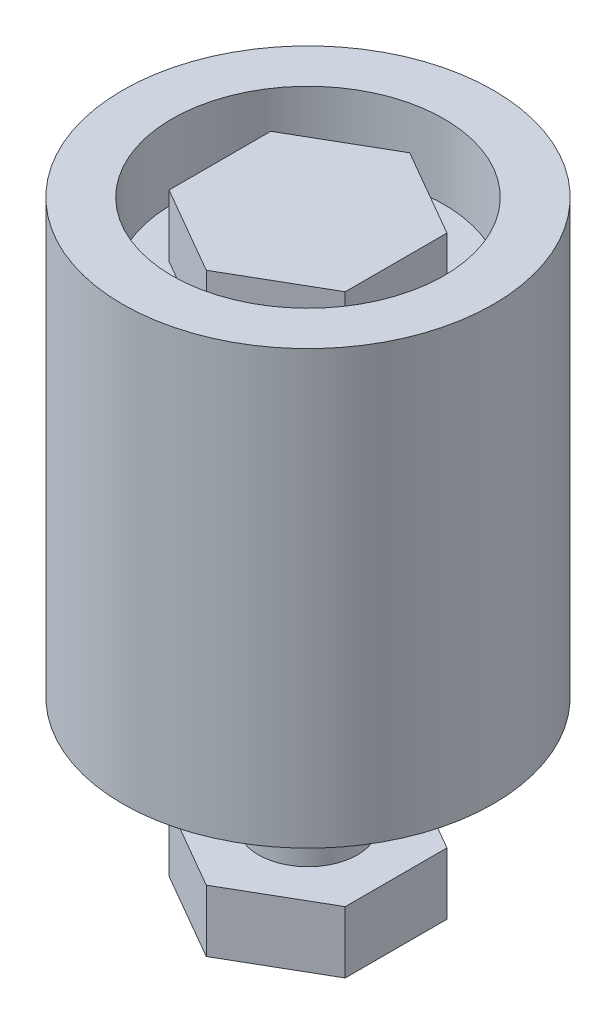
from build123d import *

# Parameters (mm, degrees)
SKETCH1_R           = 6
SKETCH1_R_2         = 4
BOSS_EXTRUDE1_DEPTH = 3
SKETCH2_R           = 15
SKETCH2_R_2         = 4
BOSS_EXTRUDE2_DEPTH = 35
SKETCH3_R           = 11
CUT_EXTRUDE1_DEPTH  = 6
BOSS_EXTRUDE4_START = -43.080000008
SKETCH4_R           = 4
BOSS_EXTRUDE4_DEPTH = 43.080000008
SKETCH5_R           = 4
BOSS_EXTRUDE5_DEPTH = 5
BOSS_EXTRUDE6_DEPTH = 5


with BuildPart() as part:
    # Sketch1 → Boss-Extrude1 (new body)
    with BuildSketch(Plane(origin=(0, 0, 0), x_dir=(1, 0, 0), z_dir=(0, 1, 0))):
        with Locations(Location((0, 0, 0), (0, 0, 270))):
            Circle(SKETCH1_R)
        with Locations(Location((0, 0, 0), (0, 0, 270))):
            Circle(SKETCH1_R_2, mode=Mode.SUBTRACT)
    extrude(amount=BOSS_EXTRUDE1_DEPTH)

    # Sketch2 → Boss-Extrude2 (add)
    with BuildSketch(Plane(origin=(0, 3, 0), x_dir=(1, 0, 0), z_dir=(0, 1, 0))):
        with Locations(Location((0, 0, 0), (0, 0, 270))):
            Circle(SKETCH2_R)
        with Locations(Location((0, 0, 0), (0, 0, 270))):
            Circle(SKETCH2_R_2, mode=Mode.SUBTRACT)
    extrude(amount=BOSS_EXTRUDE2_DEPTH)

    # Sketch3 → Cut-Extrude1 (cut)
    with BuildSketch(Plane(origin=(0, 38, 0), x_dir=(1, 0, 0), z_dir=(0, 1, 0))):
        with Locations(Location((0, 0, 0), (0, 0, 270))):
            Circle(SKETCH3_R)
    extrude(amount=-CUT_EXTRUDE1_DEPTH, mode=Mode.SUBTRACT)

    # Sketch4 → Boss-Extrude4 (add)
    with BuildSketch(Plane(origin=(0, 32, 0), x_dir=(1, 0, 0), z_dir=(0, 1, 0)).offset(BOSS_EXTRUDE4_START)):
        with Locations(Location((0, 0, 0), (0, 0, 270))):
            Circle(SKETCH4_R)
    extrude(amount=BOSS_EXTRUDE4_DEPTH)

    # Sketch5 → Boss-Extrude5 (add)
    # profile 1 of 2: a face of its own
    with BuildSketch(Plane(origin=(0, 32, 0), x_dir=(1, 0, 0), z_dir=(0, 1, 0))):
        Polygon((-7.126563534, 4.114523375), (-7.126563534, -4.114523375), (0, -8.22904675), (7.126563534, -4.114523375), (7.126563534, 4.114523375), (0, 8.22904675), align=None)
        with Locations(Location((0, 0, 0), (0, 0, 270))):
            Circle(SKETCH5_R, mode=Mode.SUBTRACT)
    # profile 2 of 2: a face of its own
    with BuildSketch(Plane(origin=(0, 32, 0), x_dir=(1, 0, 0), z_dir=(0, 1, 0))):
        with Locations(Location((0, 0, 0), (0, 0, 270))):
            Circle(SKETCH5_R)
    extrude(amount=BOSS_EXTRUDE5_DEPTH)

    # Sketch6 → Boss-Extrude6 (add)
    with BuildSketch(Plane.XZ.offset(11.080000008)):
        Polygon((7.126563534, 4.114523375), (0, 8.22904675), (-7.126563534, 4.114523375), (-7.126563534, -4.114523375), (0, -8.22904675), (7.126563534, -4.114523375), align=None)
    extrude(amount=-BOSS_EXTRUDE6_DEPTH)


solid = part.part
